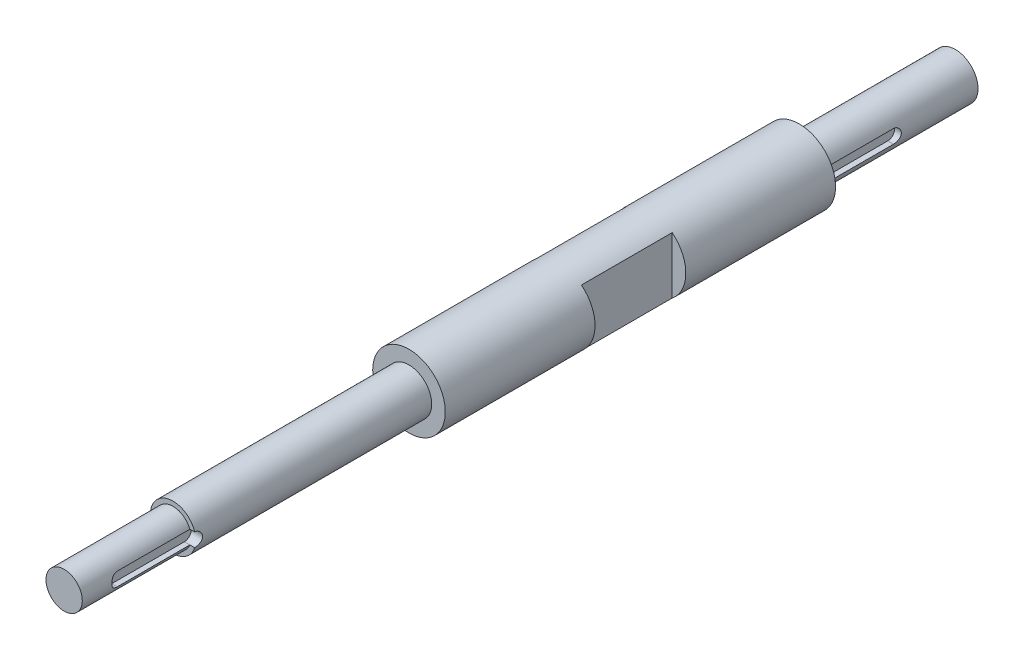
ISO-10303-21;
HEADER;
FILE_DESCRIPTION(('STEP AP214'),'2;1');
FILE_NAME('part.step','',(''),(''),'','','');
FILE_SCHEMA(('AUTOMOTIVE_DESIGN { 1 0 10303 214 1 1 1 1 }'));
ENDSEC;
DATA;
#1=APPLICATION_CONTEXT('core data for automotive mechanical design processes');
#2=APPLICATION_PROTOCOL_DEFINITION('international standard','automotive_design',2000,#1);
#3=PRODUCT_CONTEXT('',#1,'mechanical');
#4=PRODUCT('Part','Part','',(#3));
#5=PRODUCT_RELATED_PRODUCT_CATEGORY('part','',(#4));
#6=PRODUCT_DEFINITION_FORMATION('','',#4);
#7=PRODUCT_DEFINITION_CONTEXT('part definition',#1,'design');
#8=PRODUCT_DEFINITION('design','',#6,#7);
#9=PRODUCT_DEFINITION_SHAPE('','',#8);
#10=(LENGTH_UNIT() NAMED_UNIT(*) SI_UNIT(.MILLI.,.METRE.));
#11=(NAMED_UNIT(*) PLANE_ANGLE_UNIT() SI_UNIT($,.RADIAN.));
#12=(NAMED_UNIT(*) SI_UNIT($,.STERADIAN.) SOLID_ANGLE_UNIT());
#13=UNCERTAINTY_MEASURE_WITH_UNIT(LENGTH_MEASURE(1.E-05),#10,'distance_accuracy_value','');
#14=(GEOMETRIC_REPRESENTATION_CONTEXT(3) GLOBAL_UNCERTAINTY_ASSIGNED_CONTEXT((#13)) GLOBAL_UNIT_ASSIGNED_CONTEXT((#10,
#11,#12)) REPRESENTATION_CONTEXT('',''));
#15=CARTESIAN_POINT('',(0.,0.,0.));
#16=DIRECTION('',(0.,0.,1.));
#17=DIRECTION('',(1.,0.,0.));
#18=AXIS2_PLACEMENT_3D('',#15,#16,#17);
#19=CARTESIAN_POINT('',(0.,0.,38.1));
#20=DIRECTION('',(0.,0.,-1.));
#21=DIRECTION('',(-1.,0.,0.));
#22=AXIS2_PLACEMENT_3D('',#19,#20,#21);
#23=CYLINDRICAL_SURFACE('',#22,6.35);
#24=CARTESIAN_POINT('',(0.,0.,38.1));
#25=DIRECTION('',(0.,0.,1.));
#26=DIRECTION('',(1.,0.,0.));
#27=AXIS2_PLACEMENT_3D('',#24,#25,#26);
#28=CIRCLE('',#27,6.35);
#29=CARTESIAN_POINT('',(6.35,0.,38.1));
#30=VERTEX_POINT('',#29);
#31=EDGE_CURVE('E225',#30,#30,#28,.T.);
#32=ORIENTED_EDGE('',*,*,#31,.F.);
#33=EDGE_LOOP('',(#32));
#34=FACE_BOUND('',#33,.T.);
#35=DIRECTION('',(0.,0.,-1.));
#36=VECTOR('',#35,1.);
#37=CARTESIAN_POINT('',(5.88660754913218,-2.38125,38.1));
#38=LINE('',#37,#36);
#39=CARTESIAN_POINT('',(5.88660754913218,-2.38125,25.4));
#40=VERTEX_POINT('',#39);
#41=CARTESIAN_POINT('',(5.88660754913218,-2.38125,0.));
#42=VERTEX_POINT('',#41);
#43=EDGE_CURVE('E229',#40,#42,#38,.T.);
#44=ORIENTED_EDGE('',*,*,#43,.F.);
#45=CARTESIAN_POINT('',(5.88660754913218,2.38125,25.4));
#46=CARTESIAN_POINT('',(5.88659548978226,2.38125913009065,25.4644226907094));
#47=CARTESIAN_POINT('',(5.88766481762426,2.37863587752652,25.528838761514));
#48=CARTESIAN_POINT('',(5.89187627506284,2.36819587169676,25.6571594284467));
#49=CARTESIAN_POINT('',(5.89501770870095,2.36038086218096,25.7210641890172));
#50=CARTESIAN_POINT('',(5.90326887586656,2.33966527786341,25.8476832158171));
#51=CARTESIAN_POINT('',(5.90837159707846,2.3267828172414,25.9104008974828));
#52=CARTESIAN_POINT('',(5.92037365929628,2.29607189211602,26.0344224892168));
#53=CARTESIAN_POINT('',(5.92727309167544,2.27824317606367,26.0957263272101));
#54=CARTESIAN_POINT('',(5.9503477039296,2.2176005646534,26.276786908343));
#55=CARTESIAN_POINT('',(5.96891509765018,2.16759271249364,26.3939186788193));
#56=CARTESIAN_POINT('',(6.01031361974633,2.04999893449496,26.618167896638));
#57=CARTESIAN_POINT('',(6.03314823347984,1.98239862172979,26.725277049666));
#58=CARTESIAN_POINT('',(6.08176928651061,1.82795372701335,26.9317585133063));
#59=CARTESIAN_POINT('',(6.10764225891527,1.74038090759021,27.0305669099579));
#60=CARTESIAN_POINT('',(6.15870284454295,1.55002603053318,27.2124881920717));
#61=CARTESIAN_POINT('',(6.1838903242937,1.44724103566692,27.2955980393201));
#62=CARTESIAN_POINT('',(6.23177717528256,1.22506388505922,27.4465095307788));
#63=CARTESIAN_POINT('',(6.25436262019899,1.105225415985,27.5136935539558));
#64=CARTESIAN_POINT('',(6.29345381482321,0.854953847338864,27.6267100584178));
#65=CARTESIAN_POINT('',(6.30996183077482,0.724524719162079,27.6725505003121));
#66=CARTESIAN_POINT('',(6.33442171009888,0.462740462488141,27.7395903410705));
#67=CARTESIAN_POINT('',(6.34271188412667,0.331667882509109,27.7617672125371));
#68=CARTESIAN_POINT('',(6.35101622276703,0.0674145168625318,27.7839824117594));
#69=CARTESIAN_POINT('',(6.35103293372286,-0.0657656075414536,27.7840275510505));
#70=CARTESIAN_POINT('',(6.34300331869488,-0.323443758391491,27.7625463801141));
#71=CARTESIAN_POINT('',(6.33535587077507,-0.448045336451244,27.7420872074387));
#72=CARTESIAN_POINT('',(6.31338053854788,-0.691896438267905,27.681973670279));
#73=CARTESIAN_POINT('',(6.29905227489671,-0.811145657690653,27.6423182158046));
#74=CARTESIAN_POINT('',(6.26487460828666,-1.04296990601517,27.544442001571));
#75=CARTESIAN_POINT('',(6.24494786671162,-1.1554225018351,27.4859593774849));
#76=CARTESIAN_POINT('',(6.2015896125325,-1.36919723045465,27.3523201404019));
#77=CARTESIAN_POINT('',(6.1781569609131,-1.47051572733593,27.2771581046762));
#78=CARTESIAN_POINT('',(6.12858570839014,-1.66542402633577,27.1071607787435));
#79=CARTESIAN_POINT('',(6.102368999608,-1.75821624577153,27.0114325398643));
#80=CARTESIAN_POINT('',(6.05127511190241,-1.9267443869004,26.8055976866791));
#81=CARTESIAN_POINT('',(6.02639846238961,-2.00247360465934,26.6954854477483));
#82=CARTESIAN_POINT('',(5.98030090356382,-2.13626697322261,26.460834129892));
#83=CARTESIAN_POINT('',(5.95917580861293,-2.19389105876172,26.3360242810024));
#84=CARTESIAN_POINT('',(5.92409675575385,-2.2869384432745,26.0775349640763));
#85=CARTESIAN_POINT('',(5.91013075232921,-2.32239905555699,25.943870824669));
#86=CARTESIAN_POINT('',(5.89607385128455,-2.35774344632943,25.7407076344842));
#87=CARTESIAN_POINT('',(5.89253768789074,-2.36655020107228,25.6728875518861));
#88=CARTESIAN_POINT('',(5.88780085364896,-2.37830215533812,25.5367249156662));
#89=CARTESIAN_POINT('',(5.88659801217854,-2.381252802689,25.4683829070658));
#90=CARTESIAN_POINT('',(5.88660754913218,-2.38125,25.4));
#91=B_SPLINE_CURVE_WITH_KNOTS('',3,(#45,#46,#47,#48,#49,#50,#51,#52,#53,#54,#55,#56,#57,#58,#59,
#60,#61,#62,#63,#64,#65,#66,#67,#68,#69,#70,#71,#72,#73,#74,#75,#76,#77,#78,#79,#80,#81,#82,#83,
#84,#85,#86,#87,#88,#89,#90),.UNSPECIFIED.,.F.,.F.,(4,2,2,2,2,2,2,2,2,2,2,2,2,2,2,2,2,2,2,2,2,2,
4),(0.,0.193194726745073,0.386324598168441,0.578770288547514,0.771225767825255,1.15545658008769,
1.54000260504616,1.94182796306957,2.3437310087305,2.75931921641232,3.17475229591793,
3.57226821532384,3.96966179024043,4.34739430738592,4.7251482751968,5.1084014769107,
5.49177946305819,5.89755993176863,6.30349955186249,6.7186548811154,7.13310937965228,
7.33829571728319,7.54329108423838),.UNSPECIFIED.);
#92=CARTESIAN_POINT('',(5.88660754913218,2.38125,25.4));
#93=VERTEX_POINT('',#92);
#94=EDGE_CURVE('E176',#93,#40,#91,.T.);
#95=ORIENTED_EDGE('',*,*,#94,.F.);
#96=DIRECTION('',(0.,0.,-1.));
#97=VECTOR('',#96,1.);
#98=CARTESIAN_POINT('',(5.88660754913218,2.38125,38.1));
#99=LINE('',#98,#97);
#100=CARTESIAN_POINT('',(5.88660754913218,2.38125,0.));
#101=VERTEX_POINT('',#100);
#102=EDGE_CURVE('E242',#101,#93,#99,.F.);
#103=ORIENTED_EDGE('',*,*,#102,.F.);
#104=CARTESIAN_POINT('',(0.,0.,0.));
#105=DIRECTION('',(0.,0.,-1.));
#106=DIRECTION('',(-1.,0.,0.));
#107=AXIS2_PLACEMENT_3D('',#104,#105,#106);
#108=CIRCLE('',#107,6.35);
#109=EDGE_CURVE('E232',#42,#101,#108,.T.);
#110=ORIENTED_EDGE('',*,*,#109,.F.);
#111=EDGE_LOOP('',(#44,#95,#103,#110));
#112=FACE_BOUND('',#111,.T.);
#113=ADVANCED_FACE('F35',(#34,#112),#23,.T.);
#114=CARTESIAN_POINT('',(0.,0.,-82.55));
#115=DIRECTION('',(0.,0.,1.));
#116=DIRECTION('',(1.,0.,0.));
#117=AXIS2_PLACEMENT_3D('',#114,#115,#116);
#118=CYLINDRICAL_SURFACE('',#117,7.9375);
#119=CARTESIAN_POINT('',(0.,0.,-82.55));
#120=DIRECTION('',(0.,0.,-1.));
#121=DIRECTION('',(-1.,0.,0.));
#122=AXIS2_PLACEMENT_3D('',#119,#120,#121);
#123=CIRCLE('',#122,7.9375);
#124=CARTESIAN_POINT('',(-7.9375,0.,-82.55));
#125=VERTEX_POINT('',#124);
#126=EDGE_CURVE('E253',#125,#125,#123,.T.);
#127=ORIENTED_EDGE('',*,*,#126,.F.);
#128=EDGE_LOOP('',(#127));
#129=FACE_BOUND('',#128,.T.);
#130=CARTESIAN_POINT('',(7.57189241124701,-2.38125,0.));
#131=CARTESIAN_POINT('',(7.57188330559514,-2.38125815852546,-0.0653538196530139));
#132=CARTESIAN_POINT('',(7.572738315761,-2.378559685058,-0.130702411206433));
#133=CARTESIAN_POINT('',(7.57610889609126,-2.36781294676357,-0.260900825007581));
#134=CARTESIAN_POINT('',(7.57862409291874,-2.35976588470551,-0.325750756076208));
#135=CARTESIAN_POINT('',(7.58523905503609,-2.33841242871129,-0.454330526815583));
#136=CARTESIAN_POINT('',(7.58933479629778,-2.32511938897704,-0.518062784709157));
#137=CARTESIAN_POINT('',(7.59897853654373,-2.29340452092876,-0.644108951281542));
#138=CARTESIAN_POINT('',(7.60452657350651,-2.27498255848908,-0.706422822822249));
#139=CARTESIAN_POINT('',(7.62310862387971,-2.21224938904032,-0.890547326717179));
#140=CARTESIAN_POINT('',(7.63808962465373,-2.16044345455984,-1.00970432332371));
#141=CARTESIAN_POINT('',(7.67153988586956,-2.0384694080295,-1.23763567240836));
#142=CARTESIAN_POINT('',(7.69001076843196,-1.96829275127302,-1.34640516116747));
#143=CARTESIAN_POINT('',(7.72901085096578,-1.80919341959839,-1.55394262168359));
#144=CARTESIAN_POINT('',(7.74958369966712,-1.71979363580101,-1.65233736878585));
#145=CARTESIAN_POINT('',(7.79009767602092,-1.52580765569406,-1.83298593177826));
#146=CARTESIAN_POINT('',(7.81003869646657,-1.4212188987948,-1.91523702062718));
#147=CARTESIAN_POINT('',(7.84754016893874,-1.19714960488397,-2.0628981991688));
#148=CARTESIAN_POINT('',(7.86504286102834,-1.07740582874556,-2.12792483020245));
#149=CARTESIAN_POINT('',(7.89518471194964,-0.828073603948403,-2.23676924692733));
#150=CARTESIAN_POINT('',(7.9078251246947,-0.698487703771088,-2.28059250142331));
#151=CARTESIAN_POINT('',(7.92650878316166,-0.437077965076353,-2.34454664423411));
#152=CARTESIAN_POINT('',(7.93273034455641,-0.305424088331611,-2.36531920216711));
#153=CARTESIAN_POINT('',(7.93850333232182,-0.0403599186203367,-2.38461128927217));
#154=CARTESIAN_POINT('',(7.93805602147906,0.0930500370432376,-2.3831350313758));
#155=CARTESIAN_POINT('',(7.93066744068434,0.35333241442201,-2.35840125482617));
#156=CARTESIAN_POINT('',(7.92393347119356,0.480277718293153,-2.33583901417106));
#157=CARTESIAN_POINT('',(7.90498028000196,0.728487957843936,-2.27070977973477));
#158=CARTESIAN_POINT('',(7.89276077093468,0.849752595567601,-2.22814173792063));
#159=CARTESIAN_POINT('',(7.86392278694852,1.08481465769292,-2.12373809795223));
#160=CARTESIAN_POINT('',(7.84725468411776,1.19850853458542,-2.06168363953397));
#161=CARTESIAN_POINT('',(7.8112877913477,1.41409027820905,-1.92024223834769));
#162=CARTESIAN_POINT('',(7.79198841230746,1.5159754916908,-1.84085141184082));
#163=CARTESIAN_POINT('',(7.75194781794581,1.70918902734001,-1.66339521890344));
#164=CARTESIAN_POINT('',(7.73117969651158,1.79996070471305,-1.56472911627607));
#165=CARTESIAN_POINT('',(7.69118691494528,1.96384496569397,-1.35334784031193));
#166=CARTESIAN_POINT('',(7.67196270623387,2.0369523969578,-1.24062858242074));
#167=CARTESIAN_POINT('',(7.63710100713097,2.1640229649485,-1.00285402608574));
#168=CARTESIAN_POINT('',(7.62150171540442,2.21778522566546,-0.877685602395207));
#169=CARTESIAN_POINT('',(7.59611866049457,2.30323844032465,-0.619562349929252));
#170=CARTESIAN_POINT('',(7.58632600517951,2.33496315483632,-0.486619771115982));
#171=CARTESIAN_POINT('',(7.57736026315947,2.36380660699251,-0.293695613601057));
#172=CARTESIAN_POINT('',(7.57531435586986,2.37034709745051,-0.235123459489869));
#173=CARTESIAN_POINT('',(7.57258024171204,2.37906489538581,-0.117710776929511));
#174=CARTESIAN_POINT('',(7.57189003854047,2.38124861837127,-0.0588707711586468));
#175=CARTESIAN_POINT('',(7.57189241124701,2.38125,0.));
#176=B_SPLINE_CURVE_WITH_KNOTS('',3,(#130,#131,#132,#133,#134,#135,#136,#137,#138,#139,#140,
#141,#142,#143,#144,#145,#146,#147,#148,#149,#150,#151,#152,#153,#154,#155,#156,#157,#158,#159,
#160,#161,#162,#163,#164,#165,#166,#167,#168,#169,#170,#171,#172,#173,#174,#175),.UNSPECIFIED.,
.F.,.F.,(4,2,2,2,2,2,2,2,2,2,2,2,2,2,2,2,2,2,2,2,2,2,4),(0.,0.195991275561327,0.391938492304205,
0.587390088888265,0.782846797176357,1.17326844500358,1.56387201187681,1.96560376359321,
2.36740331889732,2.77751230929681,3.1875154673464,3.58579420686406,3.98399753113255,
4.36951721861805,4.7550571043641,5.14509213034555,5.53521462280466,5.94033955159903,
6.34558250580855,6.7549196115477,7.16362823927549,7.34039575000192,7.51690277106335),.UNSPECIFIED.);
#177=CARTESIAN_POINT('',(7.57189241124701,-2.38125,0.));
#178=VERTEX_POINT('',#177);
#179=CARTESIAN_POINT('',(7.57189241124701,2.38125,0.));
#180=VERTEX_POINT('',#179);
#181=EDGE_CURVE('E237',#178,#180,#176,.T.);
#182=ORIENTED_EDGE('',*,*,#181,.F.);
#183=CARTESIAN_POINT('',(0.,0.,0.));
#184=DIRECTION('',(0.,0.,-1.));
#185=DIRECTION('',(-1.,0.,0.));
#186=AXIS2_PLACEMENT_3D('',#183,#184,#185);
#187=CIRCLE('',#186,7.9375);
#188=EDGE_CURVE('E251',#178,#180,#187,.T.);
#189=ORIENTED_EDGE('',*,*,#188,.T.);
#190=EDGE_LOOP('',(#182,#189));
#191=FACE_BOUND('',#190,.T.);
#192=ADVANCED_FACE('F214',(#129,#191),#118,.T.);
#193=CARTESIAN_POINT('',(0.,0.,0.));
#194=DIRECTION('',(0.,0.,-1.));
#195=DIRECTION('',(-1.,0.,0.));
#196=AXIS2_PLACEMENT_3D('',#193,#194,#195);
#197=PLANE('',#196);
#198=DIRECTION('',(-1.,0.,0.));
#199=VECTOR('',#198,1.);
#200=CARTESIAN_POINT('',(12.7,-2.38125,0.));
#201=LINE('',#200,#199);
#202=EDGE_CURVE('E262',#42,#178,#201,.F.);
#203=ORIENTED_EDGE('',*,*,#202,.F.);
#204=ORIENTED_EDGE('',*,*,#109,.T.);
#205=DIRECTION('',(-1.,0.,0.));
#206=VECTOR('',#205,1.);
#207=CARTESIAN_POINT('',(0.,2.38125,0.));
#208=LINE('',#207,#206);
#209=EDGE_CURVE('E260',#180,#101,#208,.T.);
#210=ORIENTED_EDGE('',*,*,#209,.F.);
#211=ORIENTED_EDGE('',*,*,#188,.F.);
#212=EDGE_LOOP('',(#203,#204,#210,#211));
#213=FACE_BOUND('',#212,.T.);
#214=ADVANCED_FACE('F219',(#213),#197,.F.);
#215=CARTESIAN_POINT('',(0.,0.,38.1));
#216=DIRECTION('',(0.,0.,1.));
#217=DIRECTION('',(1.,0.,0.));
#218=AXIS2_PLACEMENT_3D('',#215,#216,#217);
#219=PLANE('',#218);
#220=ORIENTED_EDGE('',*,*,#31,.T.);
#221=EDGE_LOOP('',(#220));
#222=FACE_BOUND('',#221,.T.);
#223=ADVANCED_FACE('F382',(#222),#219,.T.);
#224=CARTESIAN_POINT('',(0.,0.,-219.075));
#225=DIRECTION('',(0.,0.,1.));
#226=DIRECTION('',(1.,0.,0.));
#227=AXIS2_PLACEMENT_3D('',#224,#225,#226);
#228=CYLINDRICAL_SURFACE('',#227,12.7);
#229=CARTESIAN_POINT('',(0.,0.,-134.9375));
#230=DIRECTION('',(0.,0.,1.));
#231=DIRECTION('',(1.,0.,0.));
#232=AXIS2_PLACEMENT_3D('',#229,#230,#231);
#233=CIRCLE('',#232,12.7);
#234=CARTESIAN_POINT('',(7.9375,-9.91393432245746,-134.9375));
#235=VERTEX_POINT('',#234);
#236=CARTESIAN_POINT('',(7.9375,9.91393432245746,-134.9375));
#237=VERTEX_POINT('',#236);
#238=EDGE_CURVE('E11',#235,#237,#233,.T.);
#239=ORIENTED_EDGE('',*,*,#238,.T.);
#240=DIRECTION('',(0.,0.,1.));
#241=VECTOR('',#240,1.);
#242=CARTESIAN_POINT('',(7.93749999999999,9.91393432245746,-219.075));
#243=LINE('',#242,#241);
#244=CARTESIAN_POINT('',(7.9375,9.91393432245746,-166.6875));
#245=VERTEX_POINT('',#244);
#246=EDGE_CURVE('E138',#237,#245,#243,.F.);
#247=ORIENTED_EDGE('',*,*,#246,.T.);
#248=CARTESIAN_POINT('',(0.,0.,-166.6875));
#249=DIRECTION('',(0.,0.,-1.));
#250=DIRECTION('',(-1.,0.,0.));
#251=AXIS2_PLACEMENT_3D('',#248,#249,#250);
#252=CIRCLE('',#251,12.7);
#253=CARTESIAN_POINT('',(7.9375,-9.91393432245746,-166.6875));
#254=VERTEX_POINT('',#253);
#255=EDGE_CURVE('E133',#245,#254,#252,.T.);
#256=ORIENTED_EDGE('',*,*,#255,.T.);
#257=DIRECTION('',(0.,0.,1.));
#258=VECTOR('',#257,1.);
#259=CARTESIAN_POINT('',(7.93749999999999,-9.91393432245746,-219.075));
#260=LINE('',#259,#258);
#261=EDGE_CURVE('E43',#254,#235,#260,.T.);
#262=ORIENTED_EDGE('',*,*,#261,.T.);
#263=EDGE_LOOP('',(#239,#247,#256,#262));
#264=FACE_BOUND('',#263,.T.);
#265=CARTESIAN_POINT('',(0.,0.,-166.6875));
#266=DIRECTION('',(0.,0.,-1.));
#267=DIRECTION('',(-1.,0.,0.));
#268=AXIS2_PLACEMENT_3D('',#265,#266,#267);
#269=CIRCLE('',#268,12.7);
#270=CARTESIAN_POINT('',(-7.9375,-9.91393432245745,-166.6875));
#271=VERTEX_POINT('',#270);
#272=CARTESIAN_POINT('',(-7.9375,9.91393432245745,-166.6875));
#273=VERTEX_POINT('',#272);
#274=EDGE_CURVE('E139',#271,#273,#269,.T.);
#275=ORIENTED_EDGE('',*,*,#274,.T.);
#276=DIRECTION('',(0.,0.,1.));
#277=VECTOR('',#276,1.);
#278=CARTESIAN_POINT('',(-7.93750000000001,9.91393432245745,-219.075));
#279=LINE('',#278,#277);
#280=CARTESIAN_POINT('',(-7.9375,9.91393432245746,-134.9375));
#281=VERTEX_POINT('',#280);
#282=EDGE_CURVE('E153',#273,#281,#279,.T.);
#283=ORIENTED_EDGE('',*,*,#282,.T.);
#284=CARTESIAN_POINT('',(0.,0.,-134.9375));
#285=DIRECTION('',(0.,0.,1.));
#286=DIRECTION('',(1.,0.,0.));
#287=AXIS2_PLACEMENT_3D('',#284,#285,#286);
#288=CIRCLE('',#287,12.7);
#289=CARTESIAN_POINT('',(-7.9375,-9.91393432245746,-134.9375));
#290=VERTEX_POINT('',#289);
#291=EDGE_CURVE('E159',#281,#290,#288,.T.);
#292=ORIENTED_EDGE('',*,*,#291,.T.);
#293=DIRECTION('',(0.,0.,1.));
#294=VECTOR('',#293,1.);
#295=CARTESIAN_POINT('',(-7.93750000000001,-9.91393432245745,-219.075));
#296=LINE('',#295,#294);
#297=EDGE_CURVE('E156',#290,#271,#296,.F.);
#298=ORIENTED_EDGE('',*,*,#297,.T.);
#299=EDGE_LOOP('',(#275,#283,#292,#298));
#300=FACE_BOUND('',#299,.T.);
#301=CARTESIAN_POINT('',(0.,0.,-219.075));
#302=DIRECTION('',(0.,0.,-1.));
#303=DIRECTION('',(-1.,0.,0.));
#304=AXIS2_PLACEMENT_3D('',#301,#302,#303);
#305=CIRCLE('',#304,12.7);
#306=CARTESIAN_POINT('',(-12.7,0.,-219.075));
#307=VERTEX_POINT('',#306);
#308=EDGE_CURVE('E240',#307,#307,#305,.T.);
#309=ORIENTED_EDGE('',*,*,#308,.F.);
#310=EDGE_LOOP('',(#309));
#311=FACE_BOUND('',#310,.T.);
#312=CARTESIAN_POINT('',(0.,0.,-82.55));
#313=DIRECTION('',(0.,0.,-1.));
#314=DIRECTION('',(-1.,0.,0.));
#315=AXIS2_PLACEMENT_3D('',#312,#313,#314);
#316=CIRCLE('',#315,12.7);
#317=CARTESIAN_POINT('',(-12.7,0.,-82.55));
#318=VERTEX_POINT('',#317);
#319=EDGE_CURVE('E236',#318,#318,#316,.T.);
#320=ORIENTED_EDGE('',*,*,#319,.T.);
#321=EDGE_LOOP('',(#320));
#322=FACE_BOUND('',#321,.T.);
#323=ADVANCED_FACE('F148',(#264,#300,#311,#322),#228,.T.);
#324=CARTESIAN_POINT('',(0.,0.,-219.075));
#325=DIRECTION('',(0.,0.,-1.));
#326=DIRECTION('',(-1.,0.,0.));
#327=AXIS2_PLACEMENT_3D('',#324,#325,#326);
#328=PLANE('',#327);
#329=DIRECTION('',(1.,0.,0.));
#330=VECTOR('',#329,1.);
#331=CARTESIAN_POINT('',(5.55625,2.38125,-219.075));
#332=LINE('',#331,#330);
#333=CARTESIAN_POINT('',(7.571892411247,2.38125,-219.075));
#334=VERTEX_POINT('',#333);
#335=CARTESIAN_POINT('',(7.9375,2.38125,-219.075));
#336=VERTEX_POINT('',#335);
#337=EDGE_CURVE('E310',#334,#336,#332,.T.);
#338=ORIENTED_EDGE('',*,*,#337,.F.);
#339=CARTESIAN_POINT('',(0.,0.,-219.075));
#340=DIRECTION('',(0.,0.,-1.));
#341=DIRECTION('',(-1.,0.,0.));
#342=AXIS2_PLACEMENT_3D('',#339,#340,#341);
#343=CIRCLE('',#342,7.9375);
#344=CARTESIAN_POINT('',(7.57189241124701,-2.38125,-219.075));
#345=VERTEX_POINT('',#344);
#346=EDGE_CURVE('E294',#345,#334,#343,.T.);
#347=ORIENTED_EDGE('',*,*,#346,.F.);
#348=DIRECTION('',(1.,0.,0.));
#349=VECTOR('',#348,1.);
#350=CARTESIAN_POINT('',(5.55625,-2.38125,-219.075));
#351=LINE('',#350,#349);
#352=CARTESIAN_POINT('',(7.9375,-2.38125,-219.075));
#353=VERTEX_POINT('',#352);
#354=EDGE_CURVE('E304',#345,#353,#351,.T.);
#355=ORIENTED_EDGE('',*,*,#354,.T.);
#356=DIRECTION('',(0.,-1.,0.));
#357=VECTOR('',#356,1.);
#358=CARTESIAN_POINT('',(7.9375,0.,-219.075));
#359=LINE('',#358,#357);
#360=EDGE_CURVE('E297',#336,#353,#359,.T.);
#361=ORIENTED_EDGE('',*,*,#360,.F.);
#362=EDGE_LOOP('',(#338,#347,#355,#361));
#363=FACE_BOUND('',#362,.T.);
#364=ORIENTED_EDGE('',*,*,#308,.T.);
#365=EDGE_LOOP('',(#364));
#366=FACE_BOUND('',#365,.T.);
#367=ADVANCED_FACE('F368',(#363,#366),#328,.T.);
#368=CARTESIAN_POINT('',(0.,0.,-82.55));
#369=DIRECTION('',(0.,0.,-1.));
#370=DIRECTION('',(-1.,0.,0.));
#371=AXIS2_PLACEMENT_3D('',#368,#369,#370);
#372=PLANE('',#371);
#373=ORIENTED_EDGE('',*,*,#126,.T.);
#374=EDGE_LOOP('',(#373));
#375=FACE_BOUND('',#374,.T.);
#376=ORIENTED_EDGE('',*,*,#319,.F.);
#377=EDGE_LOOP('',(#376));
#378=FACE_BOUND('',#377,.T.);
#379=ADVANCED_FACE('F376',(#375,#378),#372,.F.);
#380=CARTESIAN_POINT('',(12.7,0.,25.4));
#381=DIRECTION('',(-1.,0.,0.));
#382=DIRECTION('',(0.,0.,1.));
#383=AXIS2_PLACEMENT_3D('',#380,#381,#382);
#384=CYLINDRICAL_SURFACE('',#383,2.38125);
#385=ORIENTED_EDGE('',*,*,#94,.T.);
#386=DIRECTION('',(-1.,0.,0.));
#387=VECTOR('',#386,1.);
#388=CARTESIAN_POINT('',(12.7,-2.38125,25.4));
#389=LINE('',#388,#387);
#390=CARTESIAN_POINT('',(3.96875,-2.38125,25.4));
#391=VERTEX_POINT('',#390);
#392=EDGE_CURVE('E270',#40,#391,#389,.T.);
#393=ORIENTED_EDGE('',*,*,#392,.T.);
#394=CARTESIAN_POINT('',(3.96875,0.,25.4));
#395=DIRECTION('',(1.,0.,0.));
#396=DIRECTION('',(0.,0.,-1.));
#397=AXIS2_PLACEMENT_3D('',#394,#395,#396);
#398=CIRCLE('',#397,2.38125);
#399=CARTESIAN_POINT('',(3.96875,2.38125,25.4));
#400=VERTEX_POINT('',#399);
#401=EDGE_CURVE('E291',#400,#391,#398,.T.);
#402=ORIENTED_EDGE('',*,*,#401,.F.);
#403=DIRECTION('',(-1.,0.,0.));
#404=VECTOR('',#403,1.);
#405=CARTESIAN_POINT('',(12.7,2.38125,25.4));
#406=LINE('',#405,#404);
#407=EDGE_CURVE('E272',#93,#400,#406,.T.);
#408=ORIENTED_EDGE('',*,*,#407,.F.);
#409=EDGE_LOOP('',(#385,#393,#402,#408));
#410=FACE_BOUND('',#409,.T.);
#411=ADVANCED_FACE('F268',(#410),#384,.F.);
#412=CARTESIAN_POINT('',(12.7,-2.38125,25.4));
#413=DIRECTION('',(0.,1.,0.));
#414=DIRECTION('',(0.,0.,1.));
#415=AXIS2_PLACEMENT_3D('',#412,#413,#414);
#416=PLANE('',#415);
#417=ORIENTED_EDGE('',*,*,#43,.T.);
#418=DIRECTION('',(-1.,0.,0.));
#419=VECTOR('',#418,1.);
#420=CARTESIAN_POINT('',(12.7,-2.38125,0.));
#421=LINE('',#420,#419);
#422=CARTESIAN_POINT('',(3.96875,-2.38125,0.));
#423=VERTEX_POINT('',#422);
#424=EDGE_CURVE('E277',#42,#423,#421,.T.);
#425=ORIENTED_EDGE('',*,*,#424,.T.);
#426=DIRECTION('',(0.,0.,-1.));
#427=VECTOR('',#426,1.);
#428=CARTESIAN_POINT('',(3.96875,-2.38125,25.4));
#429=LINE('',#428,#427);
#430=EDGE_CURVE('E275',#391,#423,#429,.T.);
#431=ORIENTED_EDGE('',*,*,#430,.F.);
#432=ORIENTED_EDGE('',*,*,#392,.F.);
#433=EDGE_LOOP('',(#417,#425,#431,#432));
#434=FACE_BOUND('',#433,.T.);
#435=ADVANCED_FACE('F273',(#434),#416,.T.);
#436=CARTESIAN_POINT('',(12.7,0.,0.));
#437=DIRECTION('',(-1.,0.,0.));
#438=DIRECTION('',(0.,0.,1.));
#439=AXIS2_PLACEMENT_3D('',#436,#437,#438);
#440=CYLINDRICAL_SURFACE('',#439,2.38125);
#441=ORIENTED_EDGE('',*,*,#181,.T.);
#442=ORIENTED_EDGE('',*,*,#209,.T.);
#443=DIRECTION('',(-1.,0.,0.));
#444=VECTOR('',#443,1.);
#445=CARTESIAN_POINT('',(12.7,2.38125,0.));
#446=LINE('',#445,#444);
#447=CARTESIAN_POINT('',(3.96875,2.38125,0.));
#448=VERTEX_POINT('',#447);
#449=EDGE_CURVE('E279',#101,#448,#446,.T.);
#450=ORIENTED_EDGE('',*,*,#449,.T.);
#451=CARTESIAN_POINT('',(3.96875,0.,0.));
#452=DIRECTION('',(1.,0.,0.));
#453=DIRECTION('',(0.,0.,-1.));
#454=AXIS2_PLACEMENT_3D('',#451,#452,#453);
#455=CIRCLE('',#454,2.38125);
#456=EDGE_CURVE('E287',#423,#448,#455,.T.);
#457=ORIENTED_EDGE('',*,*,#456,.F.);
#458=ORIENTED_EDGE('',*,*,#424,.F.);
#459=ORIENTED_EDGE('',*,*,#202,.T.);
#460=EDGE_LOOP('',(#441,#442,#450,#457,#458,#459));
#461=FACE_BOUND('',#460,.T.);
#462=ADVANCED_FACE('F504',(#461),#440,.F.);
#463=CARTESIAN_POINT('',(12.7,2.38125,25.4));
#464=DIRECTION('',(0.,-1.,0.));
#465=DIRECTION('',(0.,0.,-1.));
#466=AXIS2_PLACEMENT_3D('',#463,#464,#465);
#467=PLANE('',#466);
#468=ORIENTED_EDGE('',*,*,#102,.T.);
#469=ORIENTED_EDGE('',*,*,#407,.T.);
#470=DIRECTION('',(0.,0.,1.));
#471=VECTOR('',#470,1.);
#472=CARTESIAN_POINT('',(3.96875,2.38125,25.4));
#473=LINE('',#472,#471);
#474=EDGE_CURVE('E284',#448,#400,#473,.T.);
#475=ORIENTED_EDGE('',*,*,#474,.F.);
#476=ORIENTED_EDGE('',*,*,#449,.F.);
#477=EDGE_LOOP('',(#468,#469,#475,#476));
#478=FACE_BOUND('',#477,.T.);
#479=ADVANCED_FACE('F498',(#478),#467,.T.);
#480=CARTESIAN_POINT('',(3.96875,0.,25.4));
#481=DIRECTION('',(1.,0.,0.));
#482=DIRECTION('',(0.,0.,-1.));
#483=AXIS2_PLACEMENT_3D('',#480,#481,#482);
#484=PLANE('',#483);
#485=ORIENTED_EDGE('',*,*,#401,.T.);
#486=ORIENTED_EDGE('',*,*,#430,.T.);
#487=ORIENTED_EDGE('',*,*,#456,.T.);
#488=ORIENTED_EDGE('',*,*,#474,.T.);
#489=EDGE_LOOP('',(#485,#486,#487,#488));
#490=FACE_BOUND('',#489,.T.);
#491=ADVANCED_FACE('F210',(#490),#484,.T.);
#492=CARTESIAN_POINT('',(0.,0.,-273.685));
#493=DIRECTION('',(0.,0.,1.));
#494=DIRECTION('',(1.,0.,0.));
#495=AXIS2_PLACEMENT_3D('',#492,#493,#494);
#496=CYLINDRICAL_SURFACE('',#495,7.9375);
#497=CARTESIAN_POINT('',(0.,0.,-273.685));
#498=DIRECTION('',(0.,0.,-1.));
#499=DIRECTION('',(-1.,0.,0.));
#500=AXIS2_PLACEMENT_3D('',#497,#498,#499);
#501=CIRCLE('',#500,7.9375);
#502=CARTESIAN_POINT('',(-7.9375,0.,-273.685));
#503=VERTEX_POINT('',#502);
#504=EDGE_CURVE('E293',#503,#503,#501,.T.);
#505=ORIENTED_EDGE('',*,*,#504,.F.);
#506=EDGE_LOOP('',(#505));
#507=FACE_BOUND('',#506,.T.);
#508=ORIENTED_EDGE('',*,*,#346,.T.);
#509=DIRECTION('',(0.,0.,1.));
#510=VECTOR('',#509,1.);
#511=CARTESIAN_POINT('',(7.57189241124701,2.38125,-273.685));
#512=LINE('',#511,#510);
#513=CARTESIAN_POINT('',(7.57189241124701,2.38125,-244.475));
#514=VERTEX_POINT('',#513);
#515=EDGE_CURVE('E162',#334,#514,#512,.F.);
#516=ORIENTED_EDGE('',*,*,#515,.T.);
#517=CARTESIAN_POINT('',(7.57189241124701,2.38125,-244.475));
#518=CARTESIAN_POINT('',(7.57188330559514,2.38125815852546,-244.540353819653));
#519=CARTESIAN_POINT('',(7.572738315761,2.378559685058,-244.605702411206));
#520=CARTESIAN_POINT('',(7.57610889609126,2.36781294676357,-244.735900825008));
#521=CARTESIAN_POINT('',(7.57862409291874,2.35976588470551,-244.800750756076));
#522=CARTESIAN_POINT('',(7.58523905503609,2.3384124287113,-244.929330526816));
#523=CARTESIAN_POINT('',(7.58933479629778,2.32511938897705,-244.993062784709));
#524=CARTESIAN_POINT('',(7.59897853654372,2.29340452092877,-245.119108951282));
#525=CARTESIAN_POINT('',(7.6045265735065,2.27498255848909,-245.181422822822));
#526=CARTESIAN_POINT('',(7.6231086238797,2.21224938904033,-245.365547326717));
#527=CARTESIAN_POINT('',(7.63808962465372,2.16044345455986,-245.484704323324));
#528=CARTESIAN_POINT('',(7.67153988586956,2.03846940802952,-245.712635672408));
#529=CARTESIAN_POINT('',(7.69001076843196,1.96829275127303,-245.821405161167));
#530=CARTESIAN_POINT('',(7.72901085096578,1.8091934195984,-246.028942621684));
#531=CARTESIAN_POINT('',(7.74958369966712,1.71979363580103,-246.127337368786));
#532=CARTESIAN_POINT('',(7.79009767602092,1.52580765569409,-246.307985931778));
#533=CARTESIAN_POINT('',(7.81003869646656,1.42121889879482,-246.390237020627));
#534=CARTESIAN_POINT('',(7.84754016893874,1.19714960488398,-246.537898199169));
#535=CARTESIAN_POINT('',(7.86504286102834,1.07740582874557,-246.602924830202));
#536=CARTESIAN_POINT('',(7.89518471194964,0.828073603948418,-246.711769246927));
#537=CARTESIAN_POINT('',(7.90782512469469,0.698487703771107,-246.755592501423));
#538=CARTESIAN_POINT('',(7.92650878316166,0.437077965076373,-246.819546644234));
#539=CARTESIAN_POINT('',(7.93273034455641,0.305424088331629,-246.840319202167));
#540=CARTESIAN_POINT('',(7.93850333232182,0.0403599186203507,-246.859611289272));
#541=CARTESIAN_POINT('',(7.93805602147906,-0.0930500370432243,-246.858135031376));
#542=CARTESIAN_POINT('',(7.93066744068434,-0.353332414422,-246.833401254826));
#543=CARTESIAN_POINT('',(7.92393347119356,-0.480277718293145,-246.810839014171));
#544=CARTESIAN_POINT('',(7.90498028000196,-0.728487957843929,-246.745709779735));
#545=CARTESIAN_POINT('',(7.89276077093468,-0.849752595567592,-246.703141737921));
#546=CARTESIAN_POINT('',(7.86392278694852,-1.08481465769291,-246.598738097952));
#547=CARTESIAN_POINT('',(7.84725468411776,-1.19850853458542,-246.536683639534));
#548=CARTESIAN_POINT('',(7.8112877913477,-1.41409027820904,-246.395242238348));
#549=CARTESIAN_POINT('',(7.79198841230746,-1.51597549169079,-246.315851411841));
#550=CARTESIAN_POINT('',(7.75194781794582,-1.70918902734,-246.138395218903));
#551=CARTESIAN_POINT('',(7.73117969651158,-1.79996070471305,-246.039729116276));
#552=CARTESIAN_POINT('',(7.69118691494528,-1.96384496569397,-245.828347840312));
#553=CARTESIAN_POINT('',(7.67196270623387,-2.0369523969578,-245.715628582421));
#554=CARTESIAN_POINT('',(7.63710100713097,-2.1640229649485,-245.477854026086));
#555=CARTESIAN_POINT('',(7.62150171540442,-2.21778522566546,-245.352685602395));
#556=CARTESIAN_POINT('',(7.59611866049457,-2.30323844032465,-245.094562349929));
#557=CARTESIAN_POINT('',(7.58632600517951,-2.33496315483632,-244.961619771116));
#558=CARTESIAN_POINT('',(7.57736026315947,-2.36380660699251,-244.768695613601));
#559=CARTESIAN_POINT('',(7.57531435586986,-2.37034709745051,-244.71012345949));
#560=CARTESIAN_POINT('',(7.57258024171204,-2.37906489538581,-244.59271077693));
#561=CARTESIAN_POINT('',(7.57189003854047,-2.38124861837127,-244.533870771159));
#562=CARTESIAN_POINT('',(7.57189241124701,-2.38125,-244.475));
#563=B_SPLINE_CURVE_WITH_KNOTS('',3,(#517,#518,#519,#520,#521,#522,#523,#524,#525,#526,#527,
#528,#529,#530,#531,#532,#533,#534,#535,#536,#537,#538,#539,#540,#541,#542,#543,#544,#545,#546,
#547,#548,#549,#550,#551,#552,#553,#554,#555,#556,#557,#558,#559,#560,#561,#562),.UNSPECIFIED.,
.F.,.F.,(4,2,2,2,2,2,2,2,2,2,2,2,2,2,2,2,2,2,2,2,2,2,4),(0.,0.19599127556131,0.391938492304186,
0.587390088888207,0.782846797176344,1.17326844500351,1.56387201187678,1.96560376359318,
2.36740331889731,2.77751230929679,3.18751546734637,3.58579420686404,3.98399753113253,
4.36951721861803,4.75505710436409,5.14509213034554,5.53521462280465,5.94033955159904,
6.34558250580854,6.75491961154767,7.16362823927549,7.34039575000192,7.51690277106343),.UNSPECIFIED.);
#564=CARTESIAN_POINT('',(7.571892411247,-2.38125,-244.475));
#565=VERTEX_POINT('',#564);
#566=EDGE_CURVE('E168',#514,#565,#563,.T.);
#567=ORIENTED_EDGE('',*,*,#566,.T.);
#568=DIRECTION('',(0.,0.,1.));
#569=VECTOR('',#568,1.);
#570=CARTESIAN_POINT('',(7.57189241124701,-2.38125,-273.685));
#571=LINE('',#570,#569);
#572=EDGE_CURVE('E165',#565,#345,#571,.T.);
#573=ORIENTED_EDGE('',*,*,#572,.T.);
#574=EDGE_LOOP('',(#508,#516,#567,#573));
#575=FACE_BOUND('',#574,.T.);
#576=ADVANCED_FACE('F182',(#507,#575),#496,.T.);
#577=CARTESIAN_POINT('',(0.,0.,-273.685));
#578=DIRECTION('',(0.,0.,-1.));
#579=DIRECTION('',(-1.,0.,0.));
#580=AXIS2_PLACEMENT_3D('',#577,#578,#579);
#581=PLANE('',#580);
#582=ORIENTED_EDGE('',*,*,#504,.T.);
#583=EDGE_LOOP('',(#582));
#584=FACE_BOUND('',#583,.T.);
#585=ADVANCED_FACE('F202',(#584),#581,.T.);
#586=CARTESIAN_POINT('',(5.55625,2.38125,-219.075));
#587=DIRECTION('',(0.,1.,0.));
#588=DIRECTION('',(0.,0.,1.));
#589=AXIS2_PLACEMENT_3D('',#586,#587,#588);
#590=PLANE('',#589);
#591=CARTESIAN_POINT('',(5.55625,2.38125,-219.075));
#592=VERTEX_POINT('',#591);
#593=EDGE_CURVE('E300',#592,#334,#332,.T.);
#594=ORIENTED_EDGE('',*,*,#593,.F.);
#595=DIRECTION('',(0.,0.,1.));
#596=VECTOR('',#595,1.);
#597=CARTESIAN_POINT('',(5.55625,2.38125,-219.075));
#598=LINE('',#597,#596);
#599=CARTESIAN_POINT('',(5.55625,2.38125,-244.475));
#600=VERTEX_POINT('',#599);
#601=EDGE_CURVE('E318',#600,#592,#598,.T.);
#602=ORIENTED_EDGE('',*,*,#601,.F.);
#603=DIRECTION('',(1.,0.,0.));
#604=VECTOR('',#603,1.);
#605=CARTESIAN_POINT('',(5.55625,2.38125,-244.475));
#606=LINE('',#605,#604);
#607=EDGE_CURVE('E307',#600,#514,#606,.T.);
#608=ORIENTED_EDGE('',*,*,#607,.T.);
#609=ORIENTED_EDGE('',*,*,#515,.F.);
#610=EDGE_LOOP('',(#594,#602,#608,#609));
#611=FACE_BOUND('',#610,.T.);
#612=ADVANCED_FACE('F192',(#611),#590,.F.);
#613=CARTESIAN_POINT('',(5.55625,0.,-244.475));
#614=DIRECTION('',(1.,0.,0.));
#615=DIRECTION('',(0.,0.,-1.));
#616=AXIS2_PLACEMENT_3D('',#613,#614,#615);
#617=CYLINDRICAL_SURFACE('',#616,2.38125);
#618=ORIENTED_EDGE('',*,*,#607,.F.);
#619=CARTESIAN_POINT('',(5.55625,0.,-244.475));
#620=DIRECTION('',(1.,0.,0.));
#621=DIRECTION('',(0.,0.,-1.));
#622=AXIS2_PLACEMENT_3D('',#619,#620,#621);
#623=CIRCLE('',#622,2.38125);
#624=CARTESIAN_POINT('',(5.55625,-2.38125,-244.475));
#625=VERTEX_POINT('',#624);
#626=EDGE_CURVE('E321',#625,#600,#623,.T.);
#627=ORIENTED_EDGE('',*,*,#626,.F.);
#628=DIRECTION('',(1.,0.,0.));
#629=VECTOR('',#628,1.);
#630=CARTESIAN_POINT('',(5.55625,-2.38125,-244.475));
#631=LINE('',#630,#629);
#632=EDGE_CURVE('E303',#625,#565,#631,.T.);
#633=ORIENTED_EDGE('',*,*,#632,.T.);
#634=ORIENTED_EDGE('',*,*,#566,.F.);
#635=EDGE_LOOP('',(#618,#627,#633,#634));
#636=FACE_BOUND('',#635,.T.);
#637=ADVANCED_FACE('F186',(#636),#617,.F.);
#638=CARTESIAN_POINT('',(5.55625,-2.38125,-219.075));
#639=DIRECTION('',(0.,-1.,0.));
#640=DIRECTION('',(0.,0.,-1.));
#641=AXIS2_PLACEMENT_3D('',#638,#639,#640);
#642=PLANE('',#641);
#643=ORIENTED_EDGE('',*,*,#632,.F.);
#644=DIRECTION('',(0.,0.,-1.));
#645=VECTOR('',#644,1.);
#646=CARTESIAN_POINT('',(5.55625,-2.38125,-219.075));
#647=LINE('',#646,#645);
#648=CARTESIAN_POINT('',(5.55625,-2.38125,-219.075));
#649=VERTEX_POINT('',#648);
#650=EDGE_CURVE('E324',#649,#625,#647,.T.);
#651=ORIENTED_EDGE('',*,*,#650,.F.);
#652=EDGE_CURVE('E301',#649,#345,#351,.T.);
#653=ORIENTED_EDGE('',*,*,#652,.T.);
#654=ORIENTED_EDGE('',*,*,#572,.F.);
#655=EDGE_LOOP('',(#643,#651,#653,#654));
#656=FACE_BOUND('',#655,.T.);
#657=ADVANCED_FACE('F191',(#656),#642,.F.);
#658=CARTESIAN_POINT('',(5.55625,0.,-219.075));
#659=DIRECTION('',(1.,0.,0.));
#660=DIRECTION('',(0.,0.,-1.));
#661=AXIS2_PLACEMENT_3D('',#658,#659,#660);
#662=CYLINDRICAL_SURFACE('',#661,2.38125);
#663=CARTESIAN_POINT('',(7.9375,0.,-219.075));
#664=DIRECTION('',(1.,0.,0.));
#665=DIRECTION('',(0.,0.,-1.));
#666=AXIS2_PLACEMENT_3D('',#663,#664,#665);
#667=CIRCLE('',#666,2.38125);
#668=EDGE_CURVE('E313',#336,#353,#667,.T.);
#669=ORIENTED_EDGE('',*,*,#668,.T.);
#670=ORIENTED_EDGE('',*,*,#354,.F.);
#671=ORIENTED_EDGE('',*,*,#652,.F.);
#672=CARTESIAN_POINT('',(5.55625,0.,-219.075));
#673=DIRECTION('',(1.,0.,0.));
#674=DIRECTION('',(0.,0.,-1.));
#675=AXIS2_PLACEMENT_3D('',#672,#673,#674);
#676=CIRCLE('',#675,2.38125);
#677=EDGE_CURVE('E316',#592,#649,#676,.T.);
#678=ORIENTED_EDGE('',*,*,#677,.F.);
#679=ORIENTED_EDGE('',*,*,#593,.T.);
#680=ORIENTED_EDGE('',*,*,#337,.T.);
#681=EDGE_LOOP('',(#669,#670,#671,#678,#679,#680));
#682=FACE_BOUND('',#681,.T.);
#683=ADVANCED_FACE('F197',(#682),#662,.F.);
#684=CARTESIAN_POINT('',(5.55625,0.,-219.075));
#685=DIRECTION('',(1.,0.,0.));
#686=DIRECTION('',(0.,0.,-1.));
#687=AXIS2_PLACEMENT_3D('',#684,#685,#686);
#688=PLANE('',#687);
#689=ORIENTED_EDGE('',*,*,#677,.T.);
#690=ORIENTED_EDGE('',*,*,#650,.T.);
#691=ORIENTED_EDGE('',*,*,#626,.T.);
#692=ORIENTED_EDGE('',*,*,#601,.T.);
#693=EDGE_LOOP('',(#689,#690,#691,#692));
#694=FACE_BOUND('',#693,.T.);
#695=ADVANCED_FACE('F200',(#694),#688,.T.);
#696=CARTESIAN_POINT('',(7.9375,0.,-219.075));
#697=DIRECTION('',(1.,0.,0.));
#698=DIRECTION('',(0.,0.,-1.));
#699=AXIS2_PLACEMENT_3D('',#696,#697,#698);
#700=PLANE('',#699);
#701=ORIENTED_EDGE('',*,*,#360,.T.);
#702=ORIENTED_EDGE('',*,*,#668,.F.);
#703=EDGE_LOOP('',(#701,#702));
#704=FACE_BOUND('',#703,.T.);
#705=ADVANCED_FACE('F350',(#704),#700,.F.);
#706=CARTESIAN_POINT('',(-12.7,-12.7,-166.6875));
#707=DIRECTION('',(0.,0.,-1.));
#708=DIRECTION('',(-1.,0.,0.));
#709=AXIS2_PLACEMENT_3D('',#706,#707,#708);
#710=PLANE('',#709);
#711=ORIENTED_EDGE('',*,*,#274,.F.);
#712=DIRECTION('',(0.,1.,0.));
#713=VECTOR('',#712,1.);
#714=CARTESIAN_POINT('',(-7.9375,-12.7,-166.6875));
#715=LINE('',#714,#713);
#716=EDGE_CURVE('E317',#271,#273,#715,.T.);
#717=ORIENTED_EDGE('',*,*,#716,.T.);
#718=EDGE_LOOP('',(#711,#717));
#719=FACE_BOUND('',#718,.T.);
#720=ADVANCED_FACE('F347',(#719),#710,.F.);
#721=CARTESIAN_POINT('',(-7.9375,-12.7,-166.6875));
#722=DIRECTION('',(1.,0.,0.));
#723=DIRECTION('',(0.,0.,-1.));
#724=AXIS2_PLACEMENT_3D('',#721,#722,#723);
#725=PLANE('',#724);
#726=ORIENTED_EDGE('',*,*,#716,.F.);
#727=ORIENTED_EDGE('',*,*,#297,.F.);
#728=DIRECTION('',(0.,1.,0.));
#729=VECTOR('',#728,1.);
#730=CARTESIAN_POINT('',(-7.9375,-12.7,-134.9375));
#731=LINE('',#730,#729);
#732=EDGE_CURVE('E56',#290,#281,#731,.T.);
#733=ORIENTED_EDGE('',*,*,#732,.T.);
#734=ORIENTED_EDGE('',*,*,#282,.F.);
#735=EDGE_LOOP('',(#726,#727,#733,#734));
#736=FACE_BOUND('',#735,.T.);
#737=ADVANCED_FACE('F342',(#736),#725,.F.);
#738=CARTESIAN_POINT('',(-12.7,-12.7,-134.9375));
#739=DIRECTION('',(0.,0.,1.));
#740=DIRECTION('',(1.,0.,0.));
#741=AXIS2_PLACEMENT_3D('',#738,#739,#740);
#742=PLANE('',#741);
#743=ORIENTED_EDGE('',*,*,#732,.F.);
#744=ORIENTED_EDGE('',*,*,#291,.F.);
#745=EDGE_LOOP('',(#743,#744));
#746=FACE_BOUND('',#745,.T.);
#747=ADVANCED_FACE('F335',(#746),#742,.F.);
#748=CARTESIAN_POINT('',(12.7,-12.7,-134.9375));
#749=DIRECTION('',(0.,0.,1.));
#750=DIRECTION('',(1.,0.,0.));
#751=AXIS2_PLACEMENT_3D('',#748,#749,#750);
#752=PLANE('',#751);
#753=ORIENTED_EDGE('',*,*,#238,.F.);
#754=DIRECTION('',(0.,1.,0.));
#755=VECTOR('',#754,1.);
#756=CARTESIAN_POINT('',(7.9375,-12.7,-134.9375));
#757=LINE('',#756,#755);
#758=EDGE_CURVE('E146',#235,#237,#757,.T.);
#759=ORIENTED_EDGE('',*,*,#758,.T.);
#760=EDGE_LOOP('',(#753,#759));
#761=FACE_BOUND('',#760,.T.);
#762=ADVANCED_FACE('F333',(#761),#752,.F.);
#763=CARTESIAN_POINT('',(7.9375,-12.7,-166.6875));
#764=DIRECTION('',(-1.,0.,0.));
#765=DIRECTION('',(0.,0.,1.));
#766=AXIS2_PLACEMENT_3D('',#763,#764,#765);
#767=PLANE('',#766);
#768=DIRECTION('',(0.,1.,0.));
#769=VECTOR('',#768,1.);
#770=CARTESIAN_POINT('',(7.9375,-12.7,-166.6875));
#771=LINE('',#770,#769);
#772=EDGE_CURVE('E49',#254,#245,#771,.T.);
#773=ORIENTED_EDGE('',*,*,#772,.T.);
#774=ORIENTED_EDGE('',*,*,#246,.F.);
#775=ORIENTED_EDGE('',*,*,#758,.F.);
#776=ORIENTED_EDGE('',*,*,#261,.F.);
#777=EDGE_LOOP('',(#773,#774,#775,#776));
#778=FACE_BOUND('',#777,.T.);
#779=ADVANCED_FACE('F143',(#778),#767,.F.);
#780=CARTESIAN_POINT('',(12.7,-12.7,-166.6875));
#781=DIRECTION('',(0.,0.,-1.));
#782=DIRECTION('',(-1.,0.,0.));
#783=AXIS2_PLACEMENT_3D('',#780,#781,#782);
#784=PLANE('',#783);
#785=ORIENTED_EDGE('',*,*,#772,.F.);
#786=ORIENTED_EDGE('',*,*,#255,.F.);
#787=EDGE_LOOP('',(#785,#786));
#788=FACE_BOUND('',#787,.T.);
#789=ADVANCED_FACE('F134',(#788),#784,.F.);
#790=CLOSED_SHELL('',(#113,#192,#214,#223,#323,#367,#379,#411,#435,#462,#479,#491,#576,#585,
#612,#637,#657,#683,#695,#705,#720,#737,#747,#762,#779,#789));
#791=MANIFOLD_SOLID_BREP('B2',#790);
#792=ADVANCED_BREP_SHAPE_REPRESENTATION('',(#18,#791),#14);
#793=SHAPE_DEFINITION_REPRESENTATION(#9,#792);
ENDSEC;
END-ISO-10303-21;
